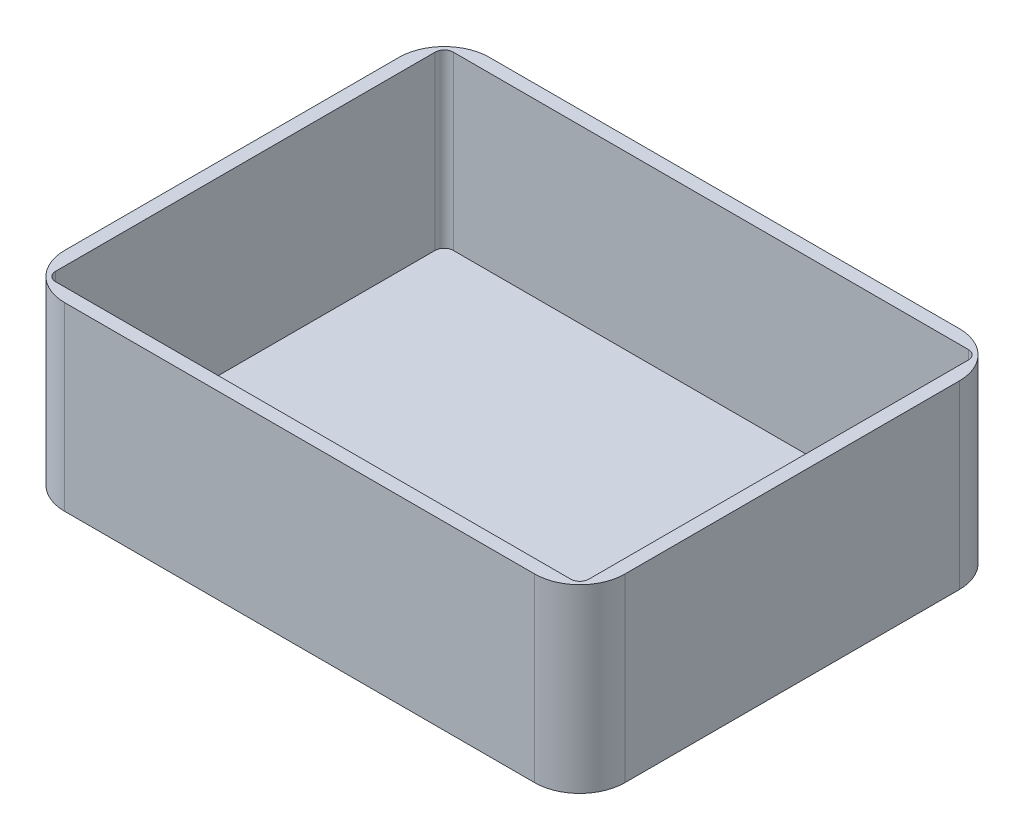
from build123d import *

# Parameters (mm, degrees)
SKETCH1_W           = 124
SKETCH1_H           = 94
BOSS_EXTRUDE1_DEPTH = 40
SKETCH2_W           = 118
SKETCH2_H           = 88
CUT_EXTRUDE1_DEPTH  = 38
FILLET2_R           = 10
FILLET3_R           = 2


with BuildPart() as part:
    # Sketch1 → Boss-Extrude1 (new body)
    with BuildSketch(Plane(origin=(0, 0, 0), x_dir=(1, 0, 0), z_dir=(0, 1, 0))):
        Rectangle(SKETCH1_W, SKETCH1_H)
    extrude(amount=BOSS_EXTRUDE1_DEPTH)

    # Sketch2 → Cut-Extrude1 (cut)
    with BuildSketch(Plane(origin=(0, 40, 0), x_dir=(1, 0, 0), z_dir=(0, 1, 0))):
        Rectangle(SKETCH2_W, SKETCH2_H)
    extrude(amount=-CUT_EXTRUDE1_DEPTH, mode=Mode.SUBTRACT)

    # Fillet2
    fillet2_edges = [part.edges().sort_by_distance(p)[0] for p in [
        (62, 20, 47),
        (-62, 20, 47),
        (-62, 20, -47),
        (62, 20, -47),
    ]]
    fillet(fillet2_edges, radius=FILLET2_R)

    # Fillet3
    fillet3_edges = [part.edges().sort_by_distance(p)[0] for p in [
        (59, 21, -44),
        (59, 21, 44),
        (-59, 21, 44),
        (-59, 21, -44),
    ]]
    fillet(fillet3_edges, radius=FILLET3_R)


solid = part.part
